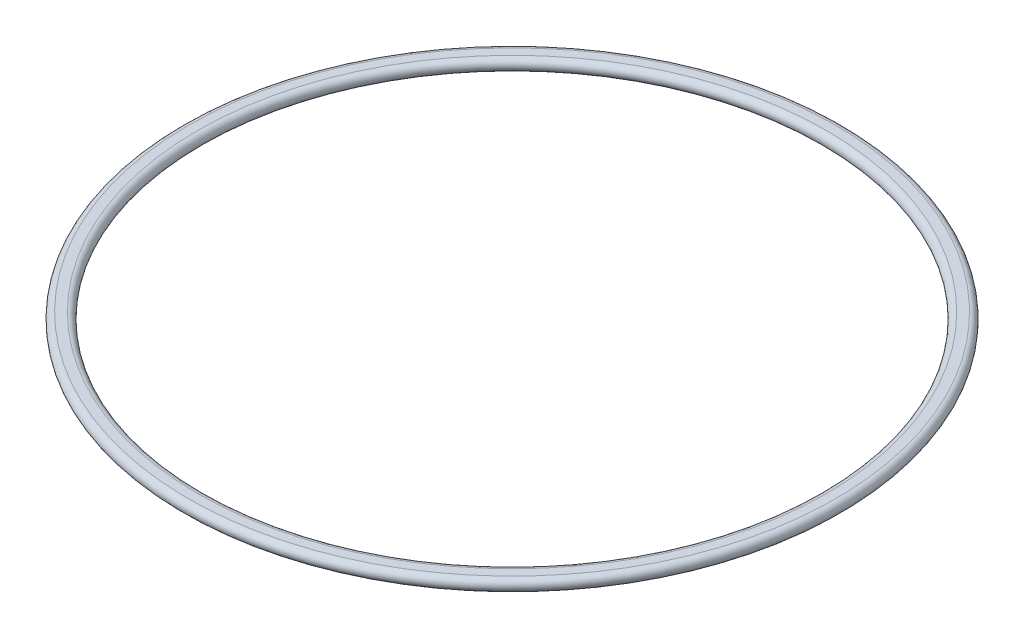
ISO-10303-21;
HEADER;
FILE_DESCRIPTION(('STEP AP214'),'2;1');
FILE_NAME('part.step','',(''),(''),'','','');
FILE_SCHEMA(('AUTOMOTIVE_DESIGN { 1 0 10303 214 1 1 1 1 }'));
ENDSEC;
DATA;
#1=APPLICATION_CONTEXT('core data for automotive mechanical design processes');
#2=APPLICATION_PROTOCOL_DEFINITION('international standard','automotive_design',2000,#1);
#3=PRODUCT_CONTEXT('',#1,'mechanical');
#4=PRODUCT('Part','Part','',(#3));
#5=PRODUCT_RELATED_PRODUCT_CATEGORY('part','',(#4));
#6=PRODUCT_DEFINITION_FORMATION('','',#4);
#7=PRODUCT_DEFINITION_CONTEXT('part definition',#1,'design');
#8=PRODUCT_DEFINITION('design','',#6,#7);
#9=PRODUCT_DEFINITION_SHAPE('','',#8);
#10=(LENGTH_UNIT() NAMED_UNIT(*) SI_UNIT(.MILLI.,.METRE.));
#11=(NAMED_UNIT(*) PLANE_ANGLE_UNIT() SI_UNIT($,.RADIAN.));
#12=(NAMED_UNIT(*) SI_UNIT($,.STERADIAN.) SOLID_ANGLE_UNIT());
#13=UNCERTAINTY_MEASURE_WITH_UNIT(LENGTH_MEASURE(1.E-05),#10,'distance_accuracy_value','');
#14=(GEOMETRIC_REPRESENTATION_CONTEXT(3) GLOBAL_UNCERTAINTY_ASSIGNED_CONTEXT((#13)) GLOBAL_UNIT_ASSIGNED_CONTEXT((#10,
#11,#12)) REPRESENTATION_CONTEXT('',''));
#15=CARTESIAN_POINT('',(0.,0.,0.));
#16=DIRECTION('',(0.,0.,1.));
#17=DIRECTION('',(1.,0.,0.));
#18=AXIS2_PLACEMENT_3D('',#15,#16,#17);
#19=CARTESIAN_POINT('',(0.,0.,0.));
#20=DIRECTION('',(0.,1.,0.));
#21=DIRECTION('',(-1.00000000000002,0.,0.));
#22=AXIS2_PLACEMENT_3D('',#19,#20,#21);
#23=TOROIDAL_SURFACE('',#22,33.65075,0.65075);
#24=CARTESIAN_POINT('',(0.,-0.650750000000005,0.));
#25=DIRECTION('',(0.,1.,0.));
#26=DIRECTION('',(-1.00000000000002,0.,0.));
#27=AXIS2_PLACEMENT_3D('',#24,#25,#26);
#28=CIRCLE('',#27,33.65075);
#29=CARTESIAN_POINT('',(-33.6507500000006,-0.650750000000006,0.));
#30=VERTEX_POINT('',#29);
#31=EDGE_CURVE('E10',#30,#30,#28,.T.);
#32=ORIENTED_EDGE('',*,*,#31,.F.);
#33=EDGE_LOOP('',(#32));
#34=FACE_BOUND('',#33,.T.);
#35=CARTESIAN_POINT('',(0.,0.650750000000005,0.));
#36=DIRECTION('',(0.,1.,0.));
#37=DIRECTION('',(-1.00000000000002,0.,0.));
#38=AXIS2_PLACEMENT_3D('',#35,#36,#37);
#39=CIRCLE('',#38,33.65075);
#40=CARTESIAN_POINT('',(-33.6507500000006,0.650750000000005,0.));
#41=VERTEX_POINT('',#40);
#42=EDGE_CURVE('E46',#41,#41,#39,.T.);
#43=ORIENTED_EDGE('',*,*,#42,.T.);
#44=EDGE_LOOP('',(#43));
#45=FACE_BOUND('',#44,.T.);
#46=ADVANCED_FACE('F32',(#34,#45),#23,.T.);
#47=CARTESIAN_POINT('',(33.6507500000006,-0.650750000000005,0.));
#48=DIRECTION('',(0.,1.,0.));
#49=DIRECTION('',(-1.00000000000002,0.,0.));
#50=AXIS2_PLACEMENT_3D('',#47,#48,#49);
#51=PLANE('',#50);
#52=CARTESIAN_POINT('',(0.,-0.650750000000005,0.));
#53=DIRECTION('',(0.,1.,0.));
#54=DIRECTION('',(-1.00000000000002,0.,0.));
#55=AXIS2_PLACEMENT_3D('',#52,#53,#54);
#56=CIRCLE('',#55,34.61975);
#57=CARTESIAN_POINT('',(-34.6197500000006,-0.650750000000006,0.));
#58=VERTEX_POINT('',#57);
#59=EDGE_CURVE('E38',#58,#58,#56,.T.);
#60=ORIENTED_EDGE('',*,*,#59,.F.);
#61=EDGE_LOOP('',(#60));
#62=FACE_BOUND('',#61,.T.);
#63=ORIENTED_EDGE('',*,*,#31,.T.);
#64=EDGE_LOOP('',(#63));
#65=FACE_BOUND('',#64,.T.);
#66=ADVANCED_FACE('F61',(#62,#65),#51,.F.);
#67=CARTESIAN_POINT('',(0.,0.,0.));
#68=DIRECTION('',(0.,1.,0.));
#69=DIRECTION('',(-1.00000000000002,0.,0.));
#70=AXIS2_PLACEMENT_3D('',#67,#68,#69);
#71=TOROIDAL_SURFACE('',#70,34.61975,0.65075);
#72=CARTESIAN_POINT('',(0.,0.650750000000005,0.));
#73=DIRECTION('',(0.,1.,0.));
#74=DIRECTION('',(-1.00000000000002,0.,0.));
#75=AXIS2_PLACEMENT_3D('',#72,#73,#74);
#76=CIRCLE('',#75,34.61975);
#77=CARTESIAN_POINT('',(-34.6197500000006,0.650750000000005,0.));
#78=VERTEX_POINT('',#77);
#79=EDGE_CURVE('E42',#78,#78,#76,.T.);
#80=ORIENTED_EDGE('',*,*,#79,.F.);
#81=EDGE_LOOP('',(#80));
#82=FACE_BOUND('',#81,.T.);
#83=ORIENTED_EDGE('',*,*,#59,.T.);
#84=EDGE_LOOP('',(#83));
#85=FACE_BOUND('',#84,.T.);
#86=ADVANCED_FACE('F56',(#82,#85),#71,.T.);
#87=CARTESIAN_POINT('',(33.6507500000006,0.650750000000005,0.));
#88=DIRECTION('',(0.,-1.,0.));
#89=DIRECTION('',(1.00000000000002,0.,0.));
#90=AXIS2_PLACEMENT_3D('',#87,#88,#89);
#91=PLANE('',#90);
#92=ORIENTED_EDGE('',*,*,#42,.F.);
#93=EDGE_LOOP('',(#92));
#94=FACE_BOUND('',#93,.T.);
#95=ORIENTED_EDGE('',*,*,#79,.T.);
#96=EDGE_LOOP('',(#95));
#97=FACE_BOUND('',#96,.T.);
#98=ADVANCED_FACE('F53',(#94,#97),#91,.F.);
#99=CLOSED_SHELL('',(#46,#66,#86,#98));
#100=MANIFOLD_SOLID_BREP('B2',#99);
#101=ADVANCED_BREP_SHAPE_REPRESENTATION('',(#18,#100),#14);
#102=SHAPE_DEFINITION_REPRESENTATION(#9,#101);
ENDSEC;
END-ISO-10303-21;
